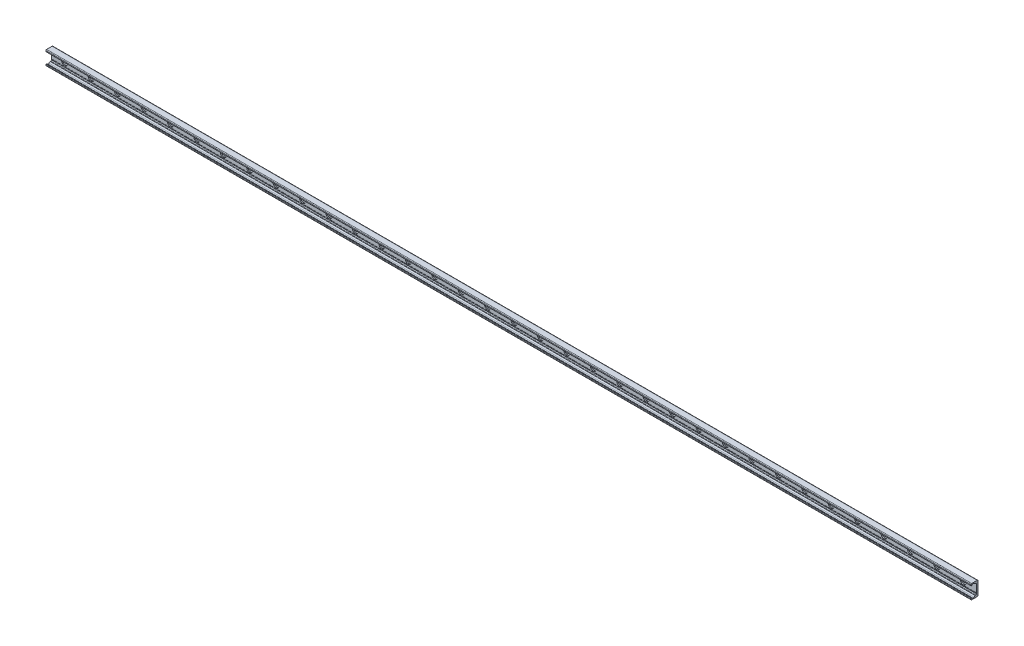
from build123d import *

# Parameters (mm, degrees)
BOSS_EXTRUDE1_DEPTH = 1400
SKETCH2_R           = 9
SKETCH2_R_2         = 4.5
CUT_EXTRUDE1_DEPTH  = 3.1
SKETCH2_2_R         = 4.5
CUT_EXTRUDE2_DEPTH  = 1401.262296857
LPATTERN1_COUNT     = 35
LPATTERN1_PITCH     = 80


with BuildPart() as part:
    # Sketch1 → Boss-Extrude1 (new, symmetric)
    with BuildSketch(Plane(origin=(0, 0, 0), x_dir=(0, 0, -1), z_dir=(1, 0, 0))):
        with BuildLine():
            Line((0, 0), (0, 19))
            ThreePointArc((0, 19), (-0.732233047, 20.767766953), (-2.5, 21.5))
            Line((-2.5, 21.5), (-19, 21.5))
            ThreePointArc((-19, 21.5), (-20.414213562, 20.914213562), (-21, 19.5))
            Line((-21, 19.5), (-21, 16.625057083))
            ThreePointArc((-21, 16.625057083), (-20.553251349, 15.888838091), (-19.693931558, 15.945160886))
            Line((-19.693931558, 15.945160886), (-16.794305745, 17.975500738))
            ThreePointArc((-16.794305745, 17.975500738), (-14.5, 18.69889256), (-12.205694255, 17.975500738))
            Line((-12.205694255, 17.975500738), (-8.829831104, 15.611695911))
            ThreePointArc((-8.829831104, 15.611695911), (-8.28408983, 15.342566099), (-7.682678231, 15.25))
            Line((-7.682678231, 15.25), (-6.5, 15.25))
            ThreePointArc((-6.5, 15.25), (-5.085786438, 14.664213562), (-4.5, 13.25))
            Line((-4.5, 13.25), (-4.5, -10.75))
            ThreePointArc((-4.5, -10.75), (-4.25, -11), (-4.5, -11.25))
            Line((-4.5, -11.25), (-4.5, -12.25))
            ThreePointArc((-4.5, -12.25), (-4.25, -12.5), (-4.5, -12.75))
            Line((-4.5, -12.75), (-4.5, -13.25))
            ThreePointArc((-4.5, -13.25), (-5.085786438, -14.664213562), (-6.5, -15.25))
            Line((-6.5, -15.25), (-7.682678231, -15.25))
            ThreePointArc((-7.682678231, -15.25), (-8.28408983, -15.342566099), (-8.829831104, -15.611695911))
            Line((-8.829831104, -15.611695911), (-12.205694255, -17.975500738))
            ThreePointArc((-12.205694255, -17.975500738), (-14.5, -18.69889256), (-16.794305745, -17.975500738))
            Line((-16.794305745, -17.975500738), (-19.693931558, -15.945160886))
            ThreePointArc((-19.693931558, -15.945160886), (-20.553251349, -15.888838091), (-21, -16.625057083))
            Line((-21, -16.625057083), (-21, -19.5))
            ThreePointArc((-21, -19.5), (-20.414213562, -20.914213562), (-19, -21.5))
            Line((-19, -21.5), (-2.5, -21.5))
            ThreePointArc((-2.5, -21.5), (-0.732233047, -20.767766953), (0, -19))
            Line((0, -19), (0, 0))
        make_face()
    extrude(amount=BOSS_EXTRUDE1_DEPTH, both=True)

    # Sketch2 → Cut-Extrude1 (cut)
    with BuildSketch(Plane.XY.offset(4.5)):
        with Locations((1360, 0)):
            Circle(SKETCH2_R)
        with Locations((1360, 0)):
            Circle(SKETCH2_R_2, mode=Mode.SUBTRACT)
    cut_extrude1 = extrude(amount=-CUT_EXTRUDE1_DEPTH, mode=Mode.SUBTRACT)

    # Sketch2_2 → Cut-Extrude2 (cut, through all)
    with BuildSketch(Plane.XY.offset(4.5)):
        with Locations((1360, 0)):
            Circle(SKETCH2_2_R)
    cut_extrude2 = extrude(amount=-CUT_EXTRUDE2_DEPTH, mode=Mode.SUBTRACT)

    # LPattern1: Cut-Extrude1, Cut-Extrude2 ×35
    with Locations(*[(-i * LPATTERN1_PITCH, 0, 0) for i in range(1, LPATTERN1_COUNT)]):
        add(cut_extrude1, mode=Mode.SUBTRACT)
        add(cut_extrude2, mode=Mode.SUBTRACT)


solid = part.part
